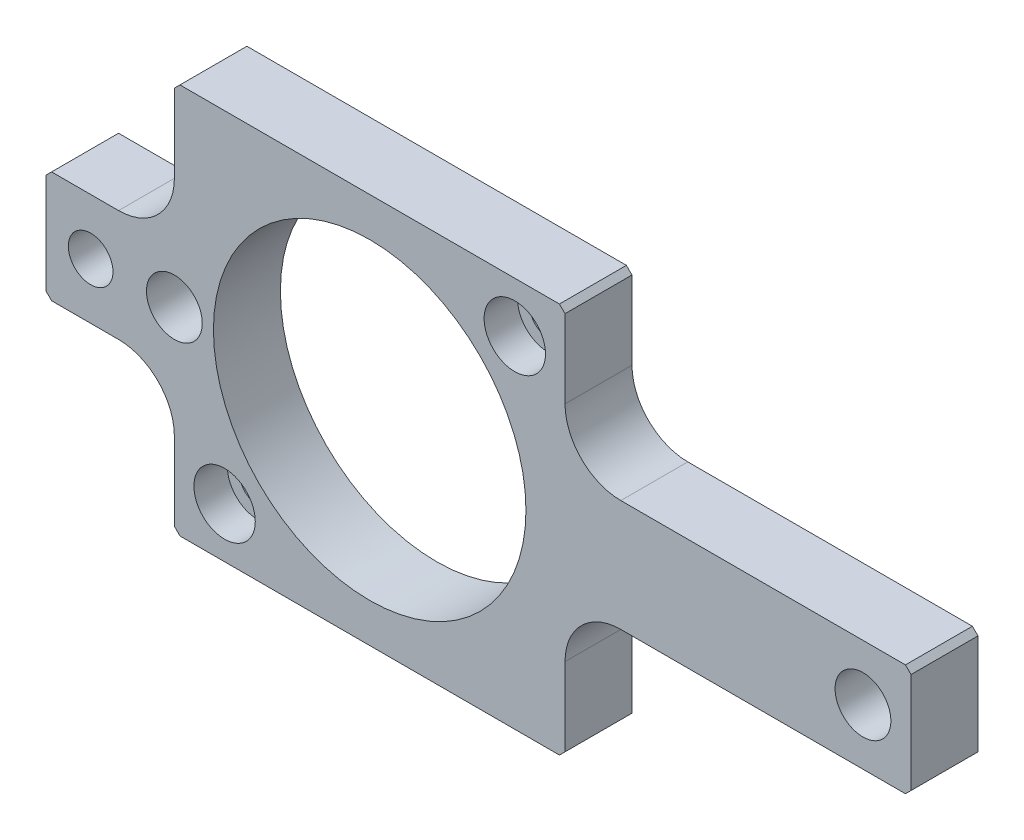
ISO-10303-21;
HEADER;
FILE_DESCRIPTION(('STEP AP214'),'2;1');
FILE_NAME('part.step','',(''),(''),'','','');
FILE_SCHEMA(('AUTOMOTIVE_DESIGN { 1 0 10303 214 1 1 1 1 }'));
ENDSEC;
DATA;
#1=APPLICATION_CONTEXT('core data for automotive mechanical design processes');
#2=APPLICATION_PROTOCOL_DEFINITION('international standard','automotive_design',2000,#1);
#3=PRODUCT_CONTEXT('',#1,'mechanical');
#4=PRODUCT('Part','Part','',(#3));
#5=PRODUCT_RELATED_PRODUCT_CATEGORY('part','',(#4));
#6=PRODUCT_DEFINITION_FORMATION('','',#4);
#7=PRODUCT_DEFINITION_CONTEXT('part definition',#1,'design');
#8=PRODUCT_DEFINITION('design','',#6,#7);
#9=PRODUCT_DEFINITION_SHAPE('','',#8);
#10=(LENGTH_UNIT() NAMED_UNIT(*) SI_UNIT(.MILLI.,.METRE.));
#11=(NAMED_UNIT(*) PLANE_ANGLE_UNIT() SI_UNIT($,.RADIAN.));
#12=(NAMED_UNIT(*) SI_UNIT($,.STERADIAN.) SOLID_ANGLE_UNIT());
#13=UNCERTAINTY_MEASURE_WITH_UNIT(LENGTH_MEASURE(1.E-05),#10,'distance_accuracy_value','');
#14=(GEOMETRIC_REPRESENTATION_CONTEXT(3) GLOBAL_UNCERTAINTY_ASSIGNED_CONTEXT((#13)) GLOBAL_UNIT_ASSIGNED_CONTEXT((#10,
#11,#12)) REPRESENTATION_CONTEXT('',''));
#15=CARTESIAN_POINT('',(0.,0.,0.));
#16=DIRECTION('',(0.,0.,1.));
#17=DIRECTION('',(1.,0.,0.));
#18=AXIS2_PLACEMENT_3D('',#15,#16,#17);
#19=CARTESIAN_POINT('',(80.,15.,12.));
#20=DIRECTION('',(0.,0.,-1.));
#21=DIRECTION('',(-1.,0.,0.));
#22=AXIS2_PLACEMENT_3D('',#19,#20,#21);
#23=PLANE('',#22);
#24=CARTESIAN_POINT('',(123.39,35.,12.));
#25=DIRECTION('',(0.,0.,1.));
#26=DIRECTION('',(1.,0.,0.));
#27=AXIS2_PLACEMENT_3D('',#24,#25,#26);
#28=CIRCLE('',#27,4.99999999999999);
#29=CARTESIAN_POINT('',(128.39,35.,12.));
#30=VERTEX_POINT('',#29);
#31=EDGE_CURVE('E514',#30,#30,#28,.T.);
#32=ORIENTED_EDGE('',*,*,#31,.F.);
#33=EDGE_LOOP('',(#32));
#34=FACE_BOUND('',#33,.T.);
#35=CARTESIAN_POINT('',(-15.,35.,12.));
#36=DIRECTION('',(0.,0.,1.));
#37=DIRECTION('',(1.,0.,0.));
#38=AXIS2_PLACEMENT_3D('',#35,#36,#37);
#39=CIRCLE('',#38,4.);
#40=CARTESIAN_POINT('',(-11.,35.,12.));
#41=VERTEX_POINT('',#40);
#42=EDGE_CURVE('E508',#41,#41,#39,.T.);
#43=ORIENTED_EDGE('',*,*,#42,.F.);
#44=EDGE_LOOP('',(#43));
#45=FACE_BOUND('',#44,.T.);
#46=CARTESIAN_POINT('',(0.,35.,12.));
#47=DIRECTION('',(0.,0.,1.));
#48=DIRECTION('',(1.,0.,0.));
#49=AXIS2_PLACEMENT_3D('',#46,#47,#48);
#50=CIRCLE('',#49,5.);
#51=CARTESIAN_POINT('',(5.,35.,12.));
#52=VERTEX_POINT('',#51);
#53=EDGE_CURVE('E502',#52,#52,#50,.T.);
#54=ORIENTED_EDGE('',*,*,#53,.F.);
#55=EDGE_LOOP('',(#54));
#56=FACE_BOUND('',#55,.T.);
#57=CARTESIAN_POINT('',(9.00000000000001,9.00000000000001,12.));
#58=DIRECTION('',(0.,0.,1.));
#59=DIRECTION('',(1.,0.,0.));
#60=AXIS2_PLACEMENT_3D('',#57,#58,#59);
#61=CIRCLE('',#60,5.5);
#62=CARTESIAN_POINT('',(14.5,9.00000000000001,12.));
#63=VERTEX_POINT('',#62);
#64=EDGE_CURVE('E496',#63,#63,#61,.T.);
#65=ORIENTED_EDGE('',*,*,#64,.F.);
#66=EDGE_LOOP('',(#65));
#67=FACE_BOUND('',#66,.T.);
#68=CARTESIAN_POINT('',(61.,61.,12.));
#69=DIRECTION('',(0.,0.,1.));
#70=DIRECTION('',(1.,0.,0.));
#71=AXIS2_PLACEMENT_3D('',#68,#69,#70);
#72=CIRCLE('',#71,5.5);
#73=CARTESIAN_POINT('',(66.5,61.,12.));
#74=VERTEX_POINT('',#73);
#75=EDGE_CURVE('E484',#74,#74,#72,.T.);
#76=ORIENTED_EDGE('',*,*,#75,.F.);
#77=EDGE_LOOP('',(#76));
#78=FACE_BOUND('',#77,.T.);
#79=DIRECTION('',(0.,-1.,0.));
#80=VECTOR('',#79,1.);
#81=CARTESIAN_POINT('',(0.,14.9999999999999,12.));
#82=LINE('',#81,#80);
#83=CARTESIAN_POINT('',(0.,14.9999999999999,12.));
#84=VERTEX_POINT('',#83);
#85=CARTESIAN_POINT('',(0.,1.00000000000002,12.));
#86=VERTEX_POINT('',#85);
#87=EDGE_CURVE('E251',#84,#86,#82,.T.);
#88=ORIENTED_EDGE('',*,*,#87,.T.);
#89=DIRECTION('',(-0.707106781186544,0.707106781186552,0.));
#90=VECTOR('',#89,1.);
#91=CARTESIAN_POINT('',(1.00000000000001,0.,12.));
#92=LINE('',#91,#90);
#93=CARTESIAN_POINT('',(1.00000000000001,0.,12.));
#94=VERTEX_POINT('',#93);
#95=EDGE_CURVE('E343',#86,#94,#92,.F.);
#96=ORIENTED_EDGE('',*,*,#95,.T.);
#97=DIRECTION('',(1.,0.,0.));
#98=VECTOR('',#97,1.);
#99=CARTESIAN_POINT('',(0.,0.,12.));
#100=LINE('',#99,#98);
#101=CARTESIAN_POINT('',(69.,0.,12.));
#102=VERTEX_POINT('',#101);
#103=EDGE_CURVE('E254',#94,#102,#100,.T.);
#104=ORIENTED_EDGE('',*,*,#103,.T.);
#105=DIRECTION('',(-0.707106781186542,-0.707106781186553,0.));
#106=VECTOR('',#105,1.);
#107=CARTESIAN_POINT('',(70.,1.00000000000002,12.));
#108=LINE('',#107,#106);
#109=CARTESIAN_POINT('',(70.,1.00000000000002,12.));
#110=VERTEX_POINT('',#109);
#111=EDGE_CURVE('E330',#102,#110,#108,.F.);
#112=ORIENTED_EDGE('',*,*,#111,.T.);
#113=DIRECTION('',(0.,1.,0.));
#114=VECTOR('',#113,1.);
#115=CARTESIAN_POINT('',(70.,0.,12.));
#116=LINE('',#115,#114);
#117=CARTESIAN_POINT('',(70.,14.9999999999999,12.));
#118=VERTEX_POINT('',#117);
#119=EDGE_CURVE('E257',#110,#118,#116,.T.);
#120=ORIENTED_EDGE('',*,*,#119,.T.);
#121=CARTESIAN_POINT('',(80.,15.,12.));
#122=DIRECTION('',(0.,0.,-1.));
#123=DIRECTION('',(-1.,0.,0.));
#124=AXIS2_PLACEMENT_3D('',#121,#122,#123);
#125=CIRCLE('',#124,10.);
#126=CARTESIAN_POINT('',(80.0000000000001,25.,12.));
#127=VERTEX_POINT('',#126);
#128=EDGE_CURVE('E211',#118,#127,#125,.T.);
#129=ORIENTED_EDGE('',*,*,#128,.T.);
#130=DIRECTION('',(1.,0.,0.));
#131=VECTOR('',#130,1.);
#132=CARTESIAN_POINT('',(80.0000000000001,25.,12.));
#133=LINE('',#132,#131);
#134=CARTESIAN_POINT('',(131.,25.,12.));
#135=VERTEX_POINT('',#134);
#136=EDGE_CURVE('E260',#127,#135,#133,.T.);
#137=ORIENTED_EDGE('',*,*,#136,.T.);
#138=DIRECTION('',(-0.707106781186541,-0.707106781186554,0.));
#139=VECTOR('',#138,1.);
#140=CARTESIAN_POINT('',(132.,26.,12.));
#141=LINE('',#140,#139);
#142=CARTESIAN_POINT('',(132.,26.,12.));
#143=VERTEX_POINT('',#142);
#144=EDGE_CURVE('E332',#135,#143,#141,.F.);
#145=ORIENTED_EDGE('',*,*,#144,.T.);
#146=DIRECTION('',(0.,1.,0.));
#147=VECTOR('',#146,1.);
#148=CARTESIAN_POINT('',(132.,25.,12.));
#149=LINE('',#148,#147);
#150=CARTESIAN_POINT('',(132.,44.,12.));
#151=VERTEX_POINT('',#150);
#152=EDGE_CURVE('E263',#143,#151,#149,.T.);
#153=ORIENTED_EDGE('',*,*,#152,.T.);
#154=DIRECTION('',(0.707106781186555,-0.70710678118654,0.));
#155=VECTOR('',#154,1.);
#156=CARTESIAN_POINT('',(131.,45.,12.));
#157=LINE('',#156,#155);
#158=CARTESIAN_POINT('',(131.,45.,12.));
#159=VERTEX_POINT('',#158);
#160=EDGE_CURVE('E334',#151,#159,#157,.F.);
#161=ORIENTED_EDGE('',*,*,#160,.T.);
#162=DIRECTION('',(-1.,0.,0.));
#163=VECTOR('',#162,1.);
#164=CARTESIAN_POINT('',(132.,45.,12.));
#165=LINE('',#164,#163);
#166=CARTESIAN_POINT('',(80.0000000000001,45.,12.));
#167=VERTEX_POINT('',#166);
#168=EDGE_CURVE('E266',#159,#167,#165,.T.);
#169=ORIENTED_EDGE('',*,*,#168,.T.);
#170=CARTESIAN_POINT('',(80.,55.,12.));
#171=DIRECTION('',(0.,0.,-1.));
#172=DIRECTION('',(1.,0.,0.));
#173=AXIS2_PLACEMENT_3D('',#170,#171,#172);
#174=CIRCLE('',#173,10.);
#175=CARTESIAN_POINT('',(70.,55.0000000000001,12.));
#176=VERTEX_POINT('',#175);
#177=EDGE_CURVE('E268',#167,#176,#174,.T.);
#178=ORIENTED_EDGE('',*,*,#177,.T.);
#179=DIRECTION('',(0.,1.,0.));
#180=VECTOR('',#179,1.);
#181=CARTESIAN_POINT('',(70.,55.0000000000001,12.));
#182=LINE('',#181,#180);
#183=CARTESIAN_POINT('',(70.,69.,12.));
#184=VERTEX_POINT('',#183);
#185=EDGE_CURVE('E270',#176,#184,#182,.T.);
#186=ORIENTED_EDGE('',*,*,#185,.T.);
#187=DIRECTION('',(0.707106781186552,-0.707106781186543,0.));
#188=VECTOR('',#187,1.);
#189=CARTESIAN_POINT('',(69.,70.,12.));
#190=LINE('',#189,#188);
#191=CARTESIAN_POINT('',(69.,70.,12.));
#192=VERTEX_POINT('',#191);
#193=EDGE_CURVE('E336',#184,#192,#190,.F.);
#194=ORIENTED_EDGE('',*,*,#193,.T.);
#195=DIRECTION('',(-1.,0.,0.));
#196=VECTOR('',#195,1.);
#197=CARTESIAN_POINT('',(70.,70.,12.));
#198=LINE('',#197,#196);
#199=CARTESIAN_POINT('',(1.,70.,12.));
#200=VERTEX_POINT('',#199);
#201=EDGE_CURVE('E273',#192,#200,#198,.T.);
#202=ORIENTED_EDGE('',*,*,#201,.T.);
#203=DIRECTION('',(0.707106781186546,0.707106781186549,0.));
#204=VECTOR('',#203,1.);
#205=CARTESIAN_POINT('',(0.,69.,12.));
#206=LINE('',#205,#204);
#207=CARTESIAN_POINT('',(0.,69.,12.));
#208=VERTEX_POINT('',#207);
#209=EDGE_CURVE('E338',#200,#208,#206,.F.);
#210=ORIENTED_EDGE('',*,*,#209,.T.);
#211=DIRECTION('',(0.,-1.,0.));
#212=VECTOR('',#211,1.);
#213=CARTESIAN_POINT('',(0.,70.,12.));
#214=LINE('',#213,#212);
#215=CARTESIAN_POINT('',(0.,55.0000000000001,12.));
#216=VERTEX_POINT('',#215);
#217=EDGE_CURVE('E276',#208,#216,#214,.T.);
#218=ORIENTED_EDGE('',*,*,#217,.T.);
#219=CARTESIAN_POINT('',(-10.,55.,12.));
#220=DIRECTION('',(0.,0.,-1.));
#221=DIRECTION('',(-1.,0.,0.));
#222=AXIS2_PLACEMENT_3D('',#219,#220,#221);
#223=CIRCLE('',#222,10.);
#224=CARTESIAN_POINT('',(-10.0000000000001,45.,12.));
#225=VERTEX_POINT('',#224);
#226=EDGE_CURVE('E278',#216,#225,#223,.T.);
#227=ORIENTED_EDGE('',*,*,#226,.T.);
#228=DIRECTION('',(-1.,0.,0.));
#229=VECTOR('',#228,1.);
#230=CARTESIAN_POINT('',(-10.0000000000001,45.,12.));
#231=LINE('',#230,#229);
#232=CARTESIAN_POINT('',(-22.,45.,12.));
#233=VERTEX_POINT('',#232);
#234=EDGE_CURVE('E280',#225,#233,#231,.T.);
#235=ORIENTED_EDGE('',*,*,#234,.T.);
#236=DIRECTION('',(0.707106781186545,0.70710678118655,0.));
#237=VECTOR('',#236,1.);
#238=CARTESIAN_POINT('',(-23.,44.,12.));
#239=LINE('',#238,#237);
#240=CARTESIAN_POINT('',(-23.,44.,12.));
#241=VERTEX_POINT('',#240);
#242=EDGE_CURVE('E340',#233,#241,#239,.F.);
#243=ORIENTED_EDGE('',*,*,#242,.T.);
#244=DIRECTION('',(0.,-1.,0.));
#245=VECTOR('',#244,1.);
#246=CARTESIAN_POINT('',(-23.,45.,12.));
#247=LINE('',#246,#245);
#248=CARTESIAN_POINT('',(-23.,26.,12.));
#249=VERTEX_POINT('',#248);
#250=EDGE_CURVE('E283',#241,#249,#247,.T.);
#251=ORIENTED_EDGE('',*,*,#250,.T.);
#252=DIRECTION('',(-0.707106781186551,0.707106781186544,0.));
#253=VECTOR('',#252,1.);
#254=CARTESIAN_POINT('',(-22.,25.,12.));
#255=LINE('',#254,#253);
#256=CARTESIAN_POINT('',(-22.,25.,12.));
#257=VERTEX_POINT('',#256);
#258=EDGE_CURVE('E47',#249,#257,#255,.F.);
#259=ORIENTED_EDGE('',*,*,#258,.T.);
#260=DIRECTION('',(1.,0.,0.));
#261=VECTOR('',#260,1.);
#262=CARTESIAN_POINT('',(-23.,25.,12.));
#263=LINE('',#262,#261);
#264=CARTESIAN_POINT('',(-10.0000000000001,25.,12.));
#265=VERTEX_POINT('',#264);
#266=EDGE_CURVE('E285',#257,#265,#263,.T.);
#267=ORIENTED_EDGE('',*,*,#266,.T.);
#268=CARTESIAN_POINT('',(-10.,15.,12.));
#269=DIRECTION('',(0.,0.,-1.));
#270=DIRECTION('',(1.,0.,0.));
#271=AXIS2_PLACEMENT_3D('',#268,#269,#270);
#272=CIRCLE('',#271,10.);
#273=EDGE_CURVE('E287',#265,#84,#272,.T.);
#274=ORIENTED_EDGE('',*,*,#273,.T.);
#275=EDGE_LOOP('',(#88,#96,#104,#112,#120,#129,#137,#145,#153,#161,#169,#178,#186,#194,#202,
#210,#218,#227,#235,#243,#251,#259,#267,#274));
#276=FACE_BOUND('',#275,.T.);
#277=CARTESIAN_POINT('',(35.,35.,12.));
#278=DIRECTION('',(0.,0.,1.));
#279=DIRECTION('',(1.,0.,0.));
#280=AXIS2_PLACEMENT_3D('',#277,#278,#279);
#281=CIRCLE('',#280,28.);
#282=CARTESIAN_POINT('',(63.,35.,12.));
#283=VERTEX_POINT('',#282);
#284=EDGE_CURVE('E467',#283,#283,#281,.T.);
#285=ORIENTED_EDGE('',*,*,#284,.F.);
#286=EDGE_LOOP('',(#285));
#287=FACE_BOUND('',#286,.T.);
#288=ADVANCED_FACE('F32',(#34,#45,#56,#67,#78,#276,#287),#23,.F.);
#289=CARTESIAN_POINT('',(80.,15.,0.));
#290=DIRECTION('',(0.,0.,-1.));
#291=DIRECTION('',(-1.,0.,0.));
#292=AXIS2_PLACEMENT_3D('',#289,#290,#291);
#293=PLANE('',#292);
#294=CARTESIAN_POINT('',(123.39,35.,-4.49293380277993E-13));
#295=DIRECTION('',(0.,0.,1.));
#296=DIRECTION('',(1.,0.,0.));
#297=AXIS2_PLACEMENT_3D('',#294,#295,#296);
#298=CIRCLE('',#297,4.99999999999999);
#299=CARTESIAN_POINT('',(128.39,35.,-4.49293380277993E-13));
#300=VERTEX_POINT('',#299);
#301=EDGE_CURVE('E511',#300,#300,#298,.T.);
#302=ORIENTED_EDGE('',*,*,#301,.T.);
#303=EDGE_LOOP('',(#302));
#304=FACE_BOUND('',#303,.T.);
#305=CARTESIAN_POINT('',(-15.,35.,-4.49293380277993E-13));
#306=DIRECTION('',(0.,0.,1.));
#307=DIRECTION('',(1.,0.,0.));
#308=AXIS2_PLACEMENT_3D('',#305,#306,#307);
#309=CIRCLE('',#308,4.);
#310=CARTESIAN_POINT('',(-11.,35.,-4.49293380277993E-13));
#311=VERTEX_POINT('',#310);
#312=EDGE_CURVE('E505',#311,#311,#309,.T.);
#313=ORIENTED_EDGE('',*,*,#312,.T.);
#314=EDGE_LOOP('',(#313));
#315=FACE_BOUND('',#314,.T.);
#316=CARTESIAN_POINT('',(0.,35.,-4.49293380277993E-13));
#317=DIRECTION('',(0.,0.,1.));
#318=DIRECTION('',(1.,0.,0.));
#319=AXIS2_PLACEMENT_3D('',#316,#317,#318);
#320=CIRCLE('',#319,5.);
#321=CARTESIAN_POINT('',(5.,35.,-4.49293380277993E-13));
#322=VERTEX_POINT('',#321);
#323=EDGE_CURVE('E499',#322,#322,#320,.T.);
#324=ORIENTED_EDGE('',*,*,#323,.T.);
#325=EDGE_LOOP('',(#324));
#326=FACE_BOUND('',#325,.T.);
#327=CARTESIAN_POINT('',(9.00000000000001,9.00000000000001,-4.49293380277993E-13));
#328=DIRECTION('',(0.,0.,1.));
#329=DIRECTION('',(1.,0.,0.));
#330=AXIS2_PLACEMENT_3D('',#327,#328,#329);
#331=CIRCLE('',#330,3.3);
#332=CARTESIAN_POINT('',(12.3,9.00000000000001,-4.49293380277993E-13));
#333=VERTEX_POINT('',#332);
#334=EDGE_CURVE('E487',#333,#333,#331,.T.);
#335=ORIENTED_EDGE('',*,*,#334,.T.);
#336=EDGE_LOOP('',(#335));
#337=FACE_BOUND('',#336,.T.);
#338=CARTESIAN_POINT('',(61.,61.,-4.49293380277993E-13));
#339=DIRECTION('',(0.,0.,1.));
#340=DIRECTION('',(1.,0.,0.));
#341=AXIS2_PLACEMENT_3D('',#338,#339,#340);
#342=CIRCLE('',#341,3.3);
#343=CARTESIAN_POINT('',(64.3,61.,-4.49293380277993E-13));
#344=VERTEX_POINT('',#343);
#345=EDGE_CURVE('E475',#344,#344,#342,.T.);
#346=ORIENTED_EDGE('',*,*,#345,.T.);
#347=EDGE_LOOP('',(#346));
#348=FACE_BOUND('',#347,.T.);
#349=DIRECTION('',(1.,0.,0.));
#350=VECTOR('',#349,1.);
#351=CARTESIAN_POINT('',(0.,0.,0.));
#352=LINE('',#351,#350);
#353=CARTESIAN_POINT('',(0.999999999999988,0.,0.));
#354=VERTEX_POINT('',#353);
#355=CARTESIAN_POINT('',(69.,0.,0.));
#356=VERTEX_POINT('',#355);
#357=EDGE_CURVE('E205',#354,#356,#352,.T.);
#358=ORIENTED_EDGE('',*,*,#357,.F.);
#359=DIRECTION('',(0.707106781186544,-0.707106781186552,0.));
#360=VECTOR('',#359,1.);
#361=CARTESIAN_POINT('',(32.9999999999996,-31.9999999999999,0.));
#362=LINE('',#361,#360);
#363=CARTESIAN_POINT('',(0.,1.00000000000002,0.));
#364=VERTEX_POINT('',#363);
#365=EDGE_CURVE('E326',#354,#364,#362,.F.);
#366=ORIENTED_EDGE('',*,*,#365,.T.);
#367=DIRECTION('',(0.,-1.,0.));
#368=VECTOR('',#367,1.);
#369=CARTESIAN_POINT('',(0.,14.9999999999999,0.));
#370=LINE('',#369,#368);
#371=CARTESIAN_POINT('',(0.,14.9999999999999,0.));
#372=VERTEX_POINT('',#371);
#373=EDGE_CURVE('E455',#372,#364,#370,.T.);
#374=ORIENTED_EDGE('',*,*,#373,.F.);
#375=CARTESIAN_POINT('',(-10.,15.,0.));
#376=DIRECTION('',(0.,0.,-1.));
#377=DIRECTION('',(1.,0.,0.));
#378=AXIS2_PLACEMENT_3D('',#375,#376,#377);
#379=CIRCLE('',#378,10.);
#380=CARTESIAN_POINT('',(-10.0000000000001,25.,0.));
#381=VERTEX_POINT('',#380);
#382=EDGE_CURVE('E249',#381,#372,#379,.T.);
#383=ORIENTED_EDGE('',*,*,#382,.F.);
#384=DIRECTION('',(1.,0.,0.));
#385=VECTOR('',#384,1.);
#386=CARTESIAN_POINT('',(-23.,25.,0.));
#387=LINE('',#386,#385);
#388=CARTESIAN_POINT('',(-22.,25.,0.));
#389=VERTEX_POINT('',#388);
#390=EDGE_CURVE('E247',#389,#381,#387,.T.);
#391=ORIENTED_EDGE('',*,*,#390,.F.);
#392=DIRECTION('',(0.707106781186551,-0.707106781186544,0.));
#393=VECTOR('',#392,1.);
#394=CARTESIAN_POINT('',(34.0000000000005,-30.9999999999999,0.));
#395=LINE('',#394,#393);
#396=CARTESIAN_POINT('',(-23.,26.,0.));
#397=VERTEX_POINT('',#396);
#398=EDGE_CURVE('E324',#389,#397,#395,.F.);
#399=ORIENTED_EDGE('',*,*,#398,.T.);
#400=DIRECTION('',(0.,-1.,0.));
#401=VECTOR('',#400,1.);
#402=CARTESIAN_POINT('',(-23.,45.,0.));
#403=LINE('',#402,#401);
#404=CARTESIAN_POINT('',(-23.,44.,0.));
#405=VERTEX_POINT('',#404);
#406=EDGE_CURVE('E245',#405,#397,#403,.T.);
#407=ORIENTED_EDGE('',*,*,#406,.F.);
#408=DIRECTION('',(-0.707106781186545,-0.70710678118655,0.));
#409=VECTOR('',#408,1.);
#410=CARTESIAN_POINT('',(13.9999999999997,80.9999999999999,0.));
#411=LINE('',#410,#409);
#412=CARTESIAN_POINT('',(-22.,45.,0.));
#413=VERTEX_POINT('',#412);
#414=EDGE_CURVE('E322',#405,#413,#411,.F.);
#415=ORIENTED_EDGE('',*,*,#414,.T.);
#416=DIRECTION('',(-1.,0.,0.));
#417=VECTOR('',#416,1.);
#418=CARTESIAN_POINT('',(-10.0000000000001,45.,0.));
#419=LINE('',#418,#417);
#420=CARTESIAN_POINT('',(-10.0000000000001,45.,0.));
#421=VERTEX_POINT('',#420);
#422=EDGE_CURVE('E242',#421,#413,#419,.T.);
#423=ORIENTED_EDGE('',*,*,#422,.F.);
#424=CARTESIAN_POINT('',(-10.,55.,0.));
#425=DIRECTION('',(0.,0.,-1.));
#426=DIRECTION('',(-1.,0.,0.));
#427=AXIS2_PLACEMENT_3D('',#424,#425,#426);
#428=CIRCLE('',#427,10.);
#429=CARTESIAN_POINT('',(0.,55.0000000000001,0.));
#430=VERTEX_POINT('',#429);
#431=EDGE_CURVE('E240',#430,#421,#428,.T.);
#432=ORIENTED_EDGE('',*,*,#431,.F.);
#433=DIRECTION('',(0.,-1.,0.));
#434=VECTOR('',#433,1.);
#435=CARTESIAN_POINT('',(0.,70.,0.));
#436=LINE('',#435,#434);
#437=CARTESIAN_POINT('',(0.,69.,0.));
#438=VERTEX_POINT('',#437);
#439=EDGE_CURVE('E238',#438,#430,#436,.T.);
#440=ORIENTED_EDGE('',*,*,#439,.F.);
#441=DIRECTION('',(-0.707106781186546,-0.707106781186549,0.));
#442=VECTOR('',#441,1.);
#443=CARTESIAN_POINT('',(12.9999999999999,81.9999999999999,0.));
#444=LINE('',#443,#442);
#445=CARTESIAN_POINT('',(1.,70.,0.));
#446=VERTEX_POINT('',#445);
#447=EDGE_CURVE('E320',#438,#446,#444,.F.);
#448=ORIENTED_EDGE('',*,*,#447,.T.);
#449=DIRECTION('',(-1.,0.,0.));
#450=VECTOR('',#449,1.);
#451=CARTESIAN_POINT('',(70.,70.,0.));
#452=LINE('',#451,#450);
#453=CARTESIAN_POINT('',(69.,70.,0.));
#454=VERTEX_POINT('',#453);
#455=EDGE_CURVE('E235',#454,#446,#452,.T.);
#456=ORIENTED_EDGE('',*,*,#455,.F.);
#457=DIRECTION('',(-0.707106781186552,0.707106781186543,0.));
#458=VECTOR('',#457,1.);
#459=CARTESIAN_POINT('',(102.,37.0000000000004,0.));
#460=LINE('',#459,#458);
#461=CARTESIAN_POINT('',(70.,69.,0.));
#462=VERTEX_POINT('',#461);
#463=EDGE_CURVE('E318',#454,#462,#460,.F.);
#464=ORIENTED_EDGE('',*,*,#463,.T.);
#465=DIRECTION('',(0.,1.,0.));
#466=VECTOR('',#465,1.);
#467=CARTESIAN_POINT('',(70.,55.0000000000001,0.));
#468=LINE('',#467,#466);
#469=CARTESIAN_POINT('',(70.,55.0000000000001,0.));
#470=VERTEX_POINT('',#469);
#471=EDGE_CURVE('E232',#470,#462,#468,.T.);
#472=ORIENTED_EDGE('',*,*,#471,.F.);
#473=CARTESIAN_POINT('',(80.,55.,0.));
#474=DIRECTION('',(0.,0.,-1.));
#475=DIRECTION('',(1.,0.,0.));
#476=AXIS2_PLACEMENT_3D('',#473,#474,#475);
#477=CIRCLE('',#476,10.);
#478=CARTESIAN_POINT('',(80.0000000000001,45.,0.));
#479=VERTEX_POINT('',#478);
#480=EDGE_CURVE('E230',#479,#470,#477,.T.);
#481=ORIENTED_EDGE('',*,*,#480,.F.);
#482=DIRECTION('',(-1.,0.,0.));
#483=VECTOR('',#482,1.);
#484=CARTESIAN_POINT('',(132.,45.,0.));
#485=LINE('',#484,#483);
#486=CARTESIAN_POINT('',(131.,45.,0.));
#487=VERTEX_POINT('',#486);
#488=EDGE_CURVE('E228',#487,#479,#485,.T.);
#489=ORIENTED_EDGE('',*,*,#488,.F.);
#490=DIRECTION('',(-0.707106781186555,0.70710678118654,0.));
#491=VECTOR('',#490,1.);
#492=CARTESIAN_POINT('',(120.499999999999,55.5000000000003,0.));
#493=LINE('',#492,#491);
#494=CARTESIAN_POINT('',(132.,44.,0.));
#495=VERTEX_POINT('',#494);
#496=EDGE_CURVE('E316',#487,#495,#493,.F.);
#497=ORIENTED_EDGE('',*,*,#496,.T.);
#498=DIRECTION('',(0.,1.,0.));
#499=VECTOR('',#498,1.);
#500=CARTESIAN_POINT('',(132.,25.,0.));
#501=LINE('',#500,#499);
#502=CARTESIAN_POINT('',(132.,26.,0.));
#503=VERTEX_POINT('',#502);
#504=EDGE_CURVE('E222',#503,#495,#501,.T.);
#505=ORIENTED_EDGE('',*,*,#504,.F.);
#506=DIRECTION('',(0.707106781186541,0.707106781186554,0.));
#507=VECTOR('',#506,1.);
#508=CARTESIAN_POINT('',(100.5,-5.50000000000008,0.));
#509=LINE('',#508,#507);
#510=CARTESIAN_POINT('',(131.,25.,0.));
#511=VERTEX_POINT('',#510);
#512=EDGE_CURVE('E314',#503,#511,#509,.F.);
#513=ORIENTED_EDGE('',*,*,#512,.T.);
#514=DIRECTION('',(1.,0.,0.));
#515=VECTOR('',#514,1.);
#516=CARTESIAN_POINT('',(80.0000000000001,25.,0.));
#517=LINE('',#516,#515);
#518=CARTESIAN_POINT('',(80.0000000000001,25.,0.));
#519=VERTEX_POINT('',#518);
#520=EDGE_CURVE('E220',#519,#511,#517,.T.);
#521=ORIENTED_EDGE('',*,*,#520,.F.);
#522=CARTESIAN_POINT('',(80.,15.,0.));
#523=DIRECTION('',(0.,0.,-1.));
#524=DIRECTION('',(-1.,0.,0.));
#525=AXIS2_PLACEMENT_3D('',#522,#523,#524);
#526=CIRCLE('',#525,10.);
#527=CARTESIAN_POINT('',(70.,14.9999999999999,0.));
#528=VERTEX_POINT('',#527);
#529=EDGE_CURVE('E204',#528,#519,#526,.T.);
#530=ORIENTED_EDGE('',*,*,#529,.F.);
#531=DIRECTION('',(0.,1.,0.));
#532=VECTOR('',#531,1.);
#533=CARTESIAN_POINT('',(70.,0.,0.));
#534=LINE('',#533,#532);
#535=CARTESIAN_POINT('',(70.,1.00000000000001,0.));
#536=VERTEX_POINT('',#535);
#537=EDGE_CURVE('E195',#536,#528,#534,.T.);
#538=ORIENTED_EDGE('',*,*,#537,.F.);
#539=DIRECTION('',(0.707106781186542,0.707106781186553,0.));
#540=VECTOR('',#539,1.);
#541=CARTESIAN_POINT('',(81.9999999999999,13.0000000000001,0.));
#542=LINE('',#541,#540);
#543=EDGE_CURVE('E312',#536,#356,#542,.F.);
#544=ORIENTED_EDGE('',*,*,#543,.T.);
#545=EDGE_LOOP('',(#358,#366,#374,#383,#391,#399,#407,#415,#423,#432,#440,#448,#456,#464,#472,
#481,#489,#497,#505,#513,#521,#530,#538,#544));
#546=FACE_BOUND('',#545,.T.);
#547=CARTESIAN_POINT('',(35.,35.,0.));
#548=DIRECTION('',(0.,0.,1.));
#549=DIRECTION('',(1.,0.,0.));
#550=AXIS2_PLACEMENT_3D('',#547,#548,#549);
#551=CIRCLE('',#550,28.);
#552=CARTESIAN_POINT('',(63.,35.,0.));
#553=VERTEX_POINT('',#552);
#554=EDGE_CURVE('E472',#553,#553,#551,.T.);
#555=ORIENTED_EDGE('',*,*,#554,.T.);
#556=EDGE_LOOP('',(#555));
#557=FACE_BOUND('',#556,.T.);
#558=ADVANCED_FACE('F217',(#304,#315,#326,#337,#348,#546,#557),#293,.T.);
#559=CARTESIAN_POINT('',(0.,14.9999999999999,12.));
#560=DIRECTION('',(1.,0.,0.));
#561=DIRECTION('',(0.,1.,0.));
#562=AXIS2_PLACEMENT_3D('',#559,#560,#561);
#563=PLANE('',#562);
#564=ORIENTED_EDGE('',*,*,#373,.T.);
#565=DIRECTION('',(0.,0.,1.));
#566=VECTOR('',#565,1.);
#567=CARTESIAN_POINT('',(0.,1.00000000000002,12.));
#568=LINE('',#567,#566);
#569=EDGE_CURVE('E328',#364,#86,#568,.T.);
#570=ORIENTED_EDGE('',*,*,#569,.T.);
#571=ORIENTED_EDGE('',*,*,#87,.F.);
#572=DIRECTION('',(0.,0.,-1.));
#573=VECTOR('',#572,1.);
#574=CARTESIAN_POINT('',(0.,14.9999999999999,12.));
#575=LINE('',#574,#573);
#576=EDGE_CURVE('E289',#84,#372,#575,.T.);
#577=ORIENTED_EDGE('',*,*,#576,.T.);
#578=EDGE_LOOP('',(#564,#570,#571,#577));
#579=FACE_BOUND('',#578,.T.);
#580=ADVANCED_FACE('F34',(#579),#563,.F.);
#581=CARTESIAN_POINT('',(0.,0.,12.));
#582=DIRECTION('',(0.,1.,0.));
#583=DIRECTION('',(0.,0.,1.));
#584=AXIS2_PLACEMENT_3D('',#581,#582,#583);
#585=PLANE('',#584);
#586=ORIENTED_EDGE('',*,*,#103,.F.);
#587=DIRECTION('',(0.,0.,-1.));
#588=VECTOR('',#587,1.);
#589=CARTESIAN_POINT('',(1.00000000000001,0.,12.));
#590=LINE('',#589,#588);
#591=EDGE_CURVE('E309',#94,#354,#590,.T.);
#592=ORIENTED_EDGE('',*,*,#591,.T.);
#593=ORIENTED_EDGE('',*,*,#357,.T.);
#594=DIRECTION('',(0.,0.,1.));
#595=VECTOR('',#594,1.);
#596=CARTESIAN_POINT('',(69.,0.,12.));
#597=LINE('',#596,#595);
#598=EDGE_CURVE('E212',#356,#102,#597,.T.);
#599=ORIENTED_EDGE('',*,*,#598,.T.);
#600=EDGE_LOOP('',(#586,#592,#593,#599));
#601=FACE_BOUND('',#600,.T.);
#602=ADVANCED_FACE('F462',(#601),#585,.F.);
#603=CARTESIAN_POINT('',(70.,0.,12.));
#604=DIRECTION('',(-1.,0.,0.));
#605=DIRECTION('',(0.,0.,1.));
#606=AXIS2_PLACEMENT_3D('',#603,#604,#605);
#607=PLANE('',#606);
#608=ORIENTED_EDGE('',*,*,#119,.F.);
#609=DIRECTION('',(0.,0.,-1.));
#610=VECTOR('',#609,1.);
#611=CARTESIAN_POINT('',(70.,1.00000000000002,12.));
#612=LINE('',#611,#610);
#613=EDGE_CURVE('E11',#110,#536,#612,.T.);
#614=ORIENTED_EDGE('',*,*,#613,.T.);
#615=ORIENTED_EDGE('',*,*,#537,.T.);
#616=DIRECTION('',(0.,0.,-1.));
#617=VECTOR('',#616,1.);
#618=CARTESIAN_POINT('',(70.,14.9999999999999,12.));
#619=LINE('',#618,#617);
#620=EDGE_CURVE('E199',#118,#528,#619,.T.);
#621=ORIENTED_EDGE('',*,*,#620,.F.);
#622=EDGE_LOOP('',(#608,#614,#615,#621));
#623=FACE_BOUND('',#622,.T.);
#624=ADVANCED_FACE('F198',(#623),#607,.F.);
#625=CARTESIAN_POINT('',(80.,15.,12.));
#626=DIRECTION('',(0.,0.,-1.));
#627=DIRECTION('',(-1.,0.,0.));
#628=AXIS2_PLACEMENT_3D('',#625,#626,#627);
#629=CYLINDRICAL_SURFACE('',#628,10.);
#630=ORIENTED_EDGE('',*,*,#529,.T.);
#631=DIRECTION('',(0.,0.,-1.));
#632=VECTOR('',#631,1.);
#633=CARTESIAN_POINT('',(80.0000000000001,25.,12.));
#634=LINE('',#633,#632);
#635=EDGE_CURVE('E213',#127,#519,#634,.T.);
#636=ORIENTED_EDGE('',*,*,#635,.F.);
#637=ORIENTED_EDGE('',*,*,#128,.F.);
#638=ORIENTED_EDGE('',*,*,#620,.T.);
#639=EDGE_LOOP('',(#630,#636,#637,#638));
#640=FACE_BOUND('',#639,.T.);
#641=ADVANCED_FACE('F208',(#640),#629,.F.);
#642=CARTESIAN_POINT('',(80.0000000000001,25.,12.));
#643=DIRECTION('',(0.,1.,0.));
#644=DIRECTION('',(-1.,0.,0.));
#645=AXIS2_PLACEMENT_3D('',#642,#643,#644);
#646=PLANE('',#645);
#647=ORIENTED_EDGE('',*,*,#520,.T.);
#648=DIRECTION('',(0.,0.,1.));
#649=VECTOR('',#648,1.);
#650=CARTESIAN_POINT('',(131.,25.,12.));
#651=LINE('',#650,#649);
#652=EDGE_CURVE('E40',#511,#135,#651,.T.);
#653=ORIENTED_EDGE('',*,*,#652,.T.);
#654=ORIENTED_EDGE('',*,*,#136,.F.);
#655=ORIENTED_EDGE('',*,*,#635,.T.);
#656=EDGE_LOOP('',(#647,#653,#654,#655));
#657=FACE_BOUND('',#656,.T.);
#658=ADVANCED_FACE('F374',(#657),#646,.F.);
#659=CARTESIAN_POINT('',(132.,25.,12.));
#660=DIRECTION('',(-1.,0.,0.));
#661=DIRECTION('',(0.,0.,1.));
#662=AXIS2_PLACEMENT_3D('',#659,#660,#661);
#663=PLANE('',#662);
#664=ORIENTED_EDGE('',*,*,#504,.T.);
#665=DIRECTION('',(0.,0.,1.));
#666=VECTOR('',#665,1.);
#667=CARTESIAN_POINT('',(132.,44.,12.));
#668=LINE('',#667,#666);
#669=EDGE_CURVE('E370',#495,#151,#668,.T.);
#670=ORIENTED_EDGE('',*,*,#669,.T.);
#671=ORIENTED_EDGE('',*,*,#152,.F.);
#672=DIRECTION('',(0.,0.,-1.));
#673=VECTOR('',#672,1.);
#674=CARTESIAN_POINT('',(132.,26.,12.));
#675=LINE('',#674,#673);
#676=EDGE_CURVE('E367',#143,#503,#675,.T.);
#677=ORIENTED_EDGE('',*,*,#676,.T.);
#678=EDGE_LOOP('',(#664,#670,#671,#677));
#679=FACE_BOUND('',#678,.T.);
#680=ADVANCED_FACE('F383',(#679),#663,.F.);
#681=CARTESIAN_POINT('',(132.,45.,12.));
#682=DIRECTION('',(0.,-1.,0.));
#683=DIRECTION('',(1.,0.,0.));
#684=AXIS2_PLACEMENT_3D('',#681,#682,#683);
#685=PLANE('',#684);
#686=ORIENTED_EDGE('',*,*,#168,.F.);
#687=DIRECTION('',(0.,0.,-1.));
#688=VECTOR('',#687,1.);
#689=CARTESIAN_POINT('',(131.,45.,12.));
#690=LINE('',#689,#688);
#691=EDGE_CURVE('E364',#159,#487,#690,.T.);
#692=ORIENTED_EDGE('',*,*,#691,.T.);
#693=ORIENTED_EDGE('',*,*,#488,.T.);
#694=DIRECTION('',(0.,0.,-1.));
#695=VECTOR('',#694,1.);
#696=CARTESIAN_POINT('',(80.0000000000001,45.,12.));
#697=LINE('',#696,#695);
#698=EDGE_CURVE('E304',#167,#479,#697,.T.);
#699=ORIENTED_EDGE('',*,*,#698,.F.);
#700=EDGE_LOOP('',(#686,#692,#693,#699));
#701=FACE_BOUND('',#700,.T.);
#702=ADVANCED_FACE('F393',(#701),#685,.F.);
#703=CARTESIAN_POINT('',(80.,55.,12.));
#704=DIRECTION('',(0.,0.,-1.));
#705=DIRECTION('',(-1.,0.,0.));
#706=AXIS2_PLACEMENT_3D('',#703,#704,#705);
#707=CYLINDRICAL_SURFACE('',#706,10.);
#708=ORIENTED_EDGE('',*,*,#480,.T.);
#709=DIRECTION('',(0.,0.,-1.));
#710=VECTOR('',#709,1.);
#711=CARTESIAN_POINT('',(70.,55.0000000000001,12.));
#712=LINE('',#711,#710);
#713=EDGE_CURVE('E301',#176,#470,#712,.T.);
#714=ORIENTED_EDGE('',*,*,#713,.F.);
#715=ORIENTED_EDGE('',*,*,#177,.F.);
#716=ORIENTED_EDGE('',*,*,#698,.T.);
#717=EDGE_LOOP('',(#708,#714,#715,#716));
#718=FACE_BOUND('',#717,.T.);
#719=ADVANCED_FACE('F400',(#718),#707,.F.);
#720=CARTESIAN_POINT('',(70.,55.0000000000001,12.));
#721=DIRECTION('',(-1.,0.,0.));
#722=DIRECTION('',(0.,-1.,0.));
#723=AXIS2_PLACEMENT_3D('',#720,#721,#722);
#724=PLANE('',#723);
#725=ORIENTED_EDGE('',*,*,#471,.T.);
#726=DIRECTION('',(0.,0.,1.));
#727=VECTOR('',#726,1.);
#728=CARTESIAN_POINT('',(70.,69.,12.));
#729=LINE('',#728,#727);
#730=EDGE_CURVE('E362',#462,#184,#729,.T.);
#731=ORIENTED_EDGE('',*,*,#730,.T.);
#732=ORIENTED_EDGE('',*,*,#185,.F.);
#733=ORIENTED_EDGE('',*,*,#713,.T.);
#734=EDGE_LOOP('',(#725,#731,#732,#733));
#735=FACE_BOUND('',#734,.T.);
#736=ADVANCED_FACE('F403',(#735),#724,.F.);
#737=CARTESIAN_POINT('',(70.,70.,12.));
#738=DIRECTION('',(0.,-1.,0.));
#739=DIRECTION('',(1.,0.,0.));
#740=AXIS2_PLACEMENT_3D('',#737,#738,#739);
#741=PLANE('',#740);
#742=ORIENTED_EDGE('',*,*,#455,.T.);
#743=DIRECTION('',(0.,0.,1.));
#744=VECTOR('',#743,1.);
#745=CARTESIAN_POINT('',(1.,70.,12.));
#746=LINE('',#745,#744);
#747=EDGE_CURVE('E360',#446,#200,#746,.T.);
#748=ORIENTED_EDGE('',*,*,#747,.T.);
#749=ORIENTED_EDGE('',*,*,#201,.F.);
#750=DIRECTION('',(0.,0.,-1.));
#751=VECTOR('',#750,1.);
#752=CARTESIAN_POINT('',(69.,70.,12.));
#753=LINE('',#752,#751);
#754=EDGE_CURVE('E357',#192,#454,#753,.T.);
#755=ORIENTED_EDGE('',*,*,#754,.T.);
#756=EDGE_LOOP('',(#742,#748,#749,#755));
#757=FACE_BOUND('',#756,.T.);
#758=ADVANCED_FACE('F411',(#757),#741,.F.);
#759=CARTESIAN_POINT('',(0.,70.,12.));
#760=DIRECTION('',(1.,0.,0.));
#761=DIRECTION('',(0.,1.,0.));
#762=AXIS2_PLACEMENT_3D('',#759,#760,#761);
#763=PLANE('',#762);
#764=ORIENTED_EDGE('',*,*,#217,.F.);
#765=DIRECTION('',(0.,0.,-1.));
#766=VECTOR('',#765,1.);
#767=CARTESIAN_POINT('',(0.,69.,12.));
#768=LINE('',#767,#766);
#769=EDGE_CURVE('E354',#208,#438,#768,.T.);
#770=ORIENTED_EDGE('',*,*,#769,.T.);
#771=ORIENTED_EDGE('',*,*,#439,.T.);
#772=DIRECTION('',(0.,0.,-1.));
#773=VECTOR('',#772,1.);
#774=CARTESIAN_POINT('',(0.,55.0000000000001,12.));
#775=LINE('',#774,#773);
#776=EDGE_CURVE('E298',#216,#430,#775,.T.);
#777=ORIENTED_EDGE('',*,*,#776,.F.);
#778=EDGE_LOOP('',(#764,#770,#771,#777));
#779=FACE_BOUND('',#778,.T.);
#780=ADVANCED_FACE('F420',(#779),#763,.F.);
#781=CARTESIAN_POINT('',(-10.,55.,12.));
#782=DIRECTION('',(0.,0.,-1.));
#783=DIRECTION('',(-1.,0.,0.));
#784=AXIS2_PLACEMENT_3D('',#781,#782,#783);
#785=CYLINDRICAL_SURFACE('',#784,10.);
#786=ORIENTED_EDGE('',*,*,#431,.T.);
#787=DIRECTION('',(0.,0.,-1.));
#788=VECTOR('',#787,1.);
#789=CARTESIAN_POINT('',(-10.0000000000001,45.,12.));
#790=LINE('',#789,#788);
#791=EDGE_CURVE('E295',#225,#421,#790,.T.);
#792=ORIENTED_EDGE('',*,*,#791,.F.);
#793=ORIENTED_EDGE('',*,*,#226,.F.);
#794=ORIENTED_EDGE('',*,*,#776,.T.);
#795=EDGE_LOOP('',(#786,#792,#793,#794));
#796=FACE_BOUND('',#795,.T.);
#797=ADVANCED_FACE('F426',(#796),#785,.F.);
#798=CARTESIAN_POINT('',(-10.0000000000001,45.,12.));
#799=DIRECTION('',(0.,-1.,0.));
#800=DIRECTION('',(0.,0.,-1.));
#801=AXIS2_PLACEMENT_3D('',#798,#799,#800);
#802=PLANE('',#801);
#803=ORIENTED_EDGE('',*,*,#422,.T.);
#804=DIRECTION('',(0.,0.,1.));
#805=VECTOR('',#804,1.);
#806=CARTESIAN_POINT('',(-22.,45.,12.));
#807=LINE('',#806,#805);
#808=EDGE_CURVE('E352',#413,#233,#807,.T.);
#809=ORIENTED_EDGE('',*,*,#808,.T.);
#810=ORIENTED_EDGE('',*,*,#234,.F.);
#811=ORIENTED_EDGE('',*,*,#791,.T.);
#812=EDGE_LOOP('',(#803,#809,#810,#811));
#813=FACE_BOUND('',#812,.T.);
#814=ADVANCED_FACE('F582',(#813),#802,.F.);
#815=CARTESIAN_POINT('',(-23.,45.,12.));
#816=DIRECTION('',(1.,0.,0.));
#817=DIRECTION('',(0.,1.,0.));
#818=AXIS2_PLACEMENT_3D('',#815,#816,#817);
#819=PLANE('',#818);
#820=ORIENTED_EDGE('',*,*,#406,.T.);
#821=DIRECTION('',(0.,0.,1.));
#822=VECTOR('',#821,1.);
#823=CARTESIAN_POINT('',(-23.,26.,12.));
#824=LINE('',#823,#822);
#825=EDGE_CURVE('E55',#397,#249,#824,.T.);
#826=ORIENTED_EDGE('',*,*,#825,.T.);
#827=ORIENTED_EDGE('',*,*,#250,.F.);
#828=DIRECTION('',(0.,0.,-1.));
#829=VECTOR('',#828,1.);
#830=CARTESIAN_POINT('',(-23.,44.,12.));
#831=LINE('',#830,#829);
#832=EDGE_CURVE('E348',#241,#405,#831,.T.);
#833=ORIENTED_EDGE('',*,*,#832,.T.);
#834=EDGE_LOOP('',(#820,#826,#827,#833));
#835=FACE_BOUND('',#834,.T.);
#836=ADVANCED_FACE('F435',(#835),#819,.F.);
#837=CARTESIAN_POINT('',(-23.,25.,12.));
#838=DIRECTION('',(0.,1.,0.));
#839=DIRECTION('',(0.,0.,1.));
#840=AXIS2_PLACEMENT_3D('',#837,#838,#839);
#841=PLANE('',#840);
#842=ORIENTED_EDGE('',*,*,#266,.F.);
#843=DIRECTION('',(0.,0.,-1.));
#844=VECTOR('',#843,1.);
#845=CARTESIAN_POINT('',(-22.,25.,12.));
#846=LINE('',#845,#844);
#847=EDGE_CURVE('E345',#257,#389,#846,.T.);
#848=ORIENTED_EDGE('',*,*,#847,.T.);
#849=ORIENTED_EDGE('',*,*,#390,.T.);
#850=DIRECTION('',(0.,0.,-1.));
#851=VECTOR('',#850,1.);
#852=CARTESIAN_POINT('',(-10.0000000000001,25.,12.));
#853=LINE('',#852,#851);
#854=EDGE_CURVE('E292',#265,#381,#853,.T.);
#855=ORIENTED_EDGE('',*,*,#854,.F.);
#856=EDGE_LOOP('',(#842,#848,#849,#855));
#857=FACE_BOUND('',#856,.T.);
#858=ADVANCED_FACE('F443',(#857),#841,.F.);
#859=CARTESIAN_POINT('',(-10.,15.,12.));
#860=DIRECTION('',(0.,0.,-1.));
#861=DIRECTION('',(-1.,0.,0.));
#862=AXIS2_PLACEMENT_3D('',#859,#860,#861);
#863=CYLINDRICAL_SURFACE('',#862,10.);
#864=ORIENTED_EDGE('',*,*,#382,.T.);
#865=ORIENTED_EDGE('',*,*,#576,.F.);
#866=ORIENTED_EDGE('',*,*,#273,.F.);
#867=ORIENTED_EDGE('',*,*,#854,.T.);
#868=EDGE_LOOP('',(#864,#865,#866,#867));
#869=FACE_BOUND('',#868,.T.);
#870=ADVANCED_FACE('F450',(#869),#863,.F.);
#871=CARTESIAN_POINT('',(35.,35.,12.));
#872=DIRECTION('',(0.,0.,-1.));
#873=DIRECTION('',(-1.,0.,0.));
#874=AXIS2_PLACEMENT_3D('',#871,#872,#873);
#875=CYLINDRICAL_SURFACE('',#874,28.);
#876=ORIENTED_EDGE('',*,*,#284,.T.);
#877=EDGE_LOOP('',(#876));
#878=FACE_BOUND('',#877,.T.);
#879=ORIENTED_EDGE('',*,*,#554,.F.);
#880=EDGE_LOOP('',(#879));
#881=FACE_BOUND('',#880,.T.);
#882=ADVANCED_FACE('F569',(#878,#881),#875,.F.);
#883=CARTESIAN_POINT('',(1.00000000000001,0.,12.));
#884=DIRECTION('',(0.707106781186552,0.707106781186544,0.));
#885=DIRECTION('',(-0.707106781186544,0.707106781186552,0.));
#886=AXIS2_PLACEMENT_3D('',#883,#884,#885);
#887=PLANE('',#886);
#888=ORIENTED_EDGE('',*,*,#95,.F.);
#889=ORIENTED_EDGE('',*,*,#569,.F.);
#890=ORIENTED_EDGE('',*,*,#365,.F.);
#891=ORIENTED_EDGE('',*,*,#591,.F.);
#892=EDGE_LOOP('',(#888,#889,#890,#891));
#893=FACE_BOUND('',#892,.T.);
#894=ADVANCED_FACE('F457',(#893),#887,.F.);
#895=CARTESIAN_POINT('',(-22.,25.,12.));
#896=DIRECTION('',(0.707106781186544,0.707106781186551,0.));
#897=DIRECTION('',(-0.707106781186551,0.707106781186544,0.));
#898=AXIS2_PLACEMENT_3D('',#895,#896,#897);
#899=PLANE('',#898);
#900=ORIENTED_EDGE('',*,*,#258,.F.);
#901=ORIENTED_EDGE('',*,*,#825,.F.);
#902=ORIENTED_EDGE('',*,*,#398,.F.);
#903=ORIENTED_EDGE('',*,*,#847,.F.);
#904=EDGE_LOOP('',(#900,#901,#902,#903));
#905=FACE_BOUND('',#904,.T.);
#906=ADVANCED_FACE('F441',(#905),#899,.F.);
#907=CARTESIAN_POINT('',(-23.,44.,12.));
#908=DIRECTION('',(0.70710678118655,-0.707106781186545,0.));
#909=DIRECTION('',(0.707106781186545,0.70710678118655,0.));
#910=AXIS2_PLACEMENT_3D('',#907,#908,#909);
#911=PLANE('',#910);
#912=ORIENTED_EDGE('',*,*,#242,.F.);
#913=ORIENTED_EDGE('',*,*,#808,.F.);
#914=ORIENTED_EDGE('',*,*,#414,.F.);
#915=ORIENTED_EDGE('',*,*,#832,.F.);
#916=EDGE_LOOP('',(#912,#913,#914,#915));
#917=FACE_BOUND('',#916,.T.);
#918=ADVANCED_FACE('F433',(#917),#911,.F.);
#919=CARTESIAN_POINT('',(0.,69.,12.));
#920=DIRECTION('',(0.707106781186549,-0.707106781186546,0.));
#921=DIRECTION('',(0.707106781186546,0.707106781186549,0.));
#922=AXIS2_PLACEMENT_3D('',#919,#920,#921);
#923=PLANE('',#922);
#924=ORIENTED_EDGE('',*,*,#209,.F.);
#925=ORIENTED_EDGE('',*,*,#747,.F.);
#926=ORIENTED_EDGE('',*,*,#447,.F.);
#927=ORIENTED_EDGE('',*,*,#769,.F.);
#928=EDGE_LOOP('',(#924,#925,#926,#927));
#929=FACE_BOUND('',#928,.T.);
#930=ADVANCED_FACE('F415',(#929),#923,.F.);
#931=CARTESIAN_POINT('',(69.,70.,12.));
#932=DIRECTION('',(-0.707106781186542,-0.707106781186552,0.));
#933=DIRECTION('',(0.707106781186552,-0.707106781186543,0.));
#934=AXIS2_PLACEMENT_3D('',#931,#932,#933);
#935=PLANE('',#934);
#936=ORIENTED_EDGE('',*,*,#193,.F.);
#937=ORIENTED_EDGE('',*,*,#730,.F.);
#938=ORIENTED_EDGE('',*,*,#463,.F.);
#939=ORIENTED_EDGE('',*,*,#754,.F.);
#940=EDGE_LOOP('',(#936,#937,#938,#939));
#941=FACE_BOUND('',#940,.T.);
#942=ADVANCED_FACE('F406',(#941),#935,.F.);
#943=CARTESIAN_POINT('',(131.,45.,12.));
#944=DIRECTION('',(-0.70710678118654,-0.707106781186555,0.));
#945=DIRECTION('',(0.707106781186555,-0.70710678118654,0.));
#946=AXIS2_PLACEMENT_3D('',#943,#944,#945);
#947=PLANE('',#946);
#948=ORIENTED_EDGE('',*,*,#160,.F.);
#949=ORIENTED_EDGE('',*,*,#669,.F.);
#950=ORIENTED_EDGE('',*,*,#496,.F.);
#951=ORIENTED_EDGE('',*,*,#691,.F.);
#952=EDGE_LOOP('',(#948,#949,#950,#951));
#953=FACE_BOUND('',#952,.T.);
#954=ADVANCED_FACE('F390',(#953),#947,.F.);
#955=CARTESIAN_POINT('',(132.,26.,12.));
#956=DIRECTION('',(-0.707106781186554,0.707106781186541,0.));
#957=DIRECTION('',(-0.707106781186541,-0.707106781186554,0.));
#958=AXIS2_PLACEMENT_3D('',#955,#956,#957);
#959=PLANE('',#958);
#960=ORIENTED_EDGE('',*,*,#144,.F.);
#961=ORIENTED_EDGE('',*,*,#652,.F.);
#962=ORIENTED_EDGE('',*,*,#512,.F.);
#963=ORIENTED_EDGE('',*,*,#676,.F.);
#964=EDGE_LOOP('',(#960,#961,#962,#963));
#965=FACE_BOUND('',#964,.T.);
#966=ADVANCED_FACE('F380',(#965),#959,.F.);
#967=CARTESIAN_POINT('',(70.,1.00000000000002,12.));
#968=DIRECTION('',(-0.707106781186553,0.707106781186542,0.));
#969=DIRECTION('',(-0.707106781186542,-0.707106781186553,0.));
#970=AXIS2_PLACEMENT_3D('',#967,#968,#969);
#971=PLANE('',#970);
#972=ORIENTED_EDGE('',*,*,#111,.F.);
#973=ORIENTED_EDGE('',*,*,#598,.F.);
#974=ORIENTED_EDGE('',*,*,#543,.F.);
#975=ORIENTED_EDGE('',*,*,#613,.F.);
#976=EDGE_LOOP('',(#972,#973,#974,#975));
#977=FACE_BOUND('',#976,.T.);
#978=ADVANCED_FACE('F466',(#977),#971,.F.);
#979=CARTESIAN_POINT('',(61.,61.,12.));
#980=DIRECTION('',(0.,0.,1.));
#981=DIRECTION('',(1.,0.,0.));
#982=AXIS2_PLACEMENT_3D('',#979,#980,#981);
#983=CYLINDRICAL_SURFACE('',#982,3.3);
#984=ORIENTED_EDGE('',*,*,#345,.F.);
#985=EDGE_LOOP('',(#984));
#986=FACE_BOUND('',#985,.T.);
#987=CARTESIAN_POINT('',(61.,61.,6.));
#988=DIRECTION('',(0.,0.,1.));
#989=DIRECTION('',(1.,0.,0.));
#990=AXIS2_PLACEMENT_3D('',#987,#988,#989);
#991=CIRCLE('',#990,3.3);
#992=CARTESIAN_POINT('',(64.3,61.,6.));
#993=VERTEX_POINT('',#992);
#994=EDGE_CURVE('E478',#993,#993,#991,.T.);
#995=ORIENTED_EDGE('',*,*,#994,.T.);
#996=EDGE_LOOP('',(#995));
#997=FACE_BOUND('',#996,.T.);
#998=ADVANCED_FACE('F544',(#986,#997),#983,.F.);
#999=CARTESIAN_POINT('',(64.3,61.,6.));
#1000=DIRECTION('',(0.,0.,-1.));
#1001=DIRECTION('',(-1.,0.,0.));
#1002=AXIS2_PLACEMENT_3D('',#999,#1000,#1001);
#1003=PLANE('',#1002);
#1004=ORIENTED_EDGE('',*,*,#994,.F.);
#1005=EDGE_LOOP('',(#1004));
#1006=FACE_BOUND('',#1005,.T.);
#1007=CARTESIAN_POINT('',(61.,61.,6.));
#1008=DIRECTION('',(0.,0.,1.));
#1009=DIRECTION('',(1.,0.,0.));
#1010=AXIS2_PLACEMENT_3D('',#1007,#1008,#1009);
#1011=CIRCLE('',#1010,5.5);
#1012=CARTESIAN_POINT('',(66.5,61.,6.));
#1013=VERTEX_POINT('',#1012);
#1014=EDGE_CURVE('E481',#1013,#1013,#1011,.T.);
#1015=ORIENTED_EDGE('',*,*,#1014,.T.);
#1016=EDGE_LOOP('',(#1015));
#1017=FACE_BOUND('',#1016,.T.);
#1018=ADVANCED_FACE('F534',(#1006,#1017),#1003,.F.);
#1019=CARTESIAN_POINT('',(61.,61.,12.));
#1020=DIRECTION('',(0.,0.,1.));
#1021=DIRECTION('',(1.,0.,0.));
#1022=AXIS2_PLACEMENT_3D('',#1019,#1020,#1021);
#1023=CYLINDRICAL_SURFACE('',#1022,5.5);
#1024=ORIENTED_EDGE('',*,*,#1014,.F.);
#1025=EDGE_LOOP('',(#1024));
#1026=FACE_BOUND('',#1025,.T.);
#1027=ORIENTED_EDGE('',*,*,#75,.T.);
#1028=EDGE_LOOP('',(#1027));
#1029=FACE_BOUND('',#1028,.T.);
#1030=ADVANCED_FACE('F531',(#1026,#1029),#1023,.F.);
#1031=CARTESIAN_POINT('',(9.00000000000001,9.00000000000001,12.));
#1032=DIRECTION('',(0.,0.,1.));
#1033=DIRECTION('',(1.,0.,0.));
#1034=AXIS2_PLACEMENT_3D('',#1031,#1032,#1033);
#1035=CYLINDRICAL_SURFACE('',#1034,3.3);
#1036=ORIENTED_EDGE('',*,*,#334,.F.);
#1037=EDGE_LOOP('',(#1036));
#1038=FACE_BOUND('',#1037,.T.);
#1039=CARTESIAN_POINT('',(9.00000000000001,9.00000000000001,6.));
#1040=DIRECTION('',(0.,0.,1.));
#1041=DIRECTION('',(1.,0.,0.));
#1042=AXIS2_PLACEMENT_3D('',#1039,#1040,#1041);
#1043=CIRCLE('',#1042,3.3);
#1044=CARTESIAN_POINT('',(12.3,9.00000000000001,6.));
#1045=VERTEX_POINT('',#1044);
#1046=EDGE_CURVE('E490',#1045,#1045,#1043,.T.);
#1047=ORIENTED_EDGE('',*,*,#1046,.T.);
#1048=EDGE_LOOP('',(#1047));
#1049=FACE_BOUND('',#1048,.T.);
#1050=ADVANCED_FACE('F533',(#1038,#1049),#1035,.F.);
#1051=CARTESIAN_POINT('',(12.3,9.00000000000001,6.));
#1052=DIRECTION('',(0.,0.,-1.));
#1053=DIRECTION('',(-1.,0.,0.));
#1054=AXIS2_PLACEMENT_3D('',#1051,#1052,#1053);
#1055=PLANE('',#1054);
#1056=ORIENTED_EDGE('',*,*,#1046,.F.);
#1057=EDGE_LOOP('',(#1056));
#1058=FACE_BOUND('',#1057,.T.);
#1059=CARTESIAN_POINT('',(9.00000000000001,9.00000000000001,6.));
#1060=DIRECTION('',(0.,0.,1.));
#1061=DIRECTION('',(1.,0.,0.));
#1062=AXIS2_PLACEMENT_3D('',#1059,#1060,#1061);
#1063=CIRCLE('',#1062,5.5);
#1064=CARTESIAN_POINT('',(14.5,9.00000000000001,6.));
#1065=VERTEX_POINT('',#1064);
#1066=EDGE_CURVE('E493',#1065,#1065,#1063,.T.);
#1067=ORIENTED_EDGE('',*,*,#1066,.T.);
#1068=EDGE_LOOP('',(#1067));
#1069=FACE_BOUND('',#1068,.T.);
#1070=ADVANCED_FACE('F541',(#1058,#1069),#1055,.F.);
#1071=CARTESIAN_POINT('',(9.00000000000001,9.00000000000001,12.));
#1072=DIRECTION('',(0.,0.,1.));
#1073=DIRECTION('',(1.,0.,0.));
#1074=AXIS2_PLACEMENT_3D('',#1071,#1072,#1073);
#1075=CYLINDRICAL_SURFACE('',#1074,5.5);
#1076=ORIENTED_EDGE('',*,*,#1066,.F.);
#1077=EDGE_LOOP('',(#1076));
#1078=FACE_BOUND('',#1077,.T.);
#1079=ORIENTED_EDGE('',*,*,#64,.T.);
#1080=EDGE_LOOP('',(#1079));
#1081=FACE_BOUND('',#1080,.T.);
#1082=ADVANCED_FACE('F770',(#1078,#1081),#1075,.F.);
#1083=CARTESIAN_POINT('',(0.,35.,-4.49293380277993E-13));
#1084=DIRECTION('',(0.,0.,1.));
#1085=DIRECTION('',(1.,0.,0.));
#1086=AXIS2_PLACEMENT_3D('',#1083,#1084,#1085);
#1087=CYLINDRICAL_SURFACE('',#1086,5.);
#1088=ORIENTED_EDGE('',*,*,#323,.F.);
#1089=EDGE_LOOP('',(#1088));
#1090=FACE_BOUND('',#1089,.T.);
#1091=ORIENTED_EDGE('',*,*,#53,.T.);
#1092=EDGE_LOOP('',(#1091));
#1093=FACE_BOUND('',#1092,.T.);
#1094=ADVANCED_FACE('F778',(#1090,#1093),#1087,.F.);
#1095=CARTESIAN_POINT('',(-15.,35.,-4.49293380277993E-13));
#1096=DIRECTION('',(0.,0.,1.));
#1097=DIRECTION('',(1.,0.,0.));
#1098=AXIS2_PLACEMENT_3D('',#1095,#1096,#1097);
#1099=CYLINDRICAL_SURFACE('',#1098,4.);
#1100=ORIENTED_EDGE('',*,*,#312,.F.);
#1101=EDGE_LOOP('',(#1100));
#1102=FACE_BOUND('',#1101,.T.);
#1103=ORIENTED_EDGE('',*,*,#42,.T.);
#1104=EDGE_LOOP('',(#1103));
#1105=FACE_BOUND('',#1104,.T.);
#1106=ADVANCED_FACE('F787',(#1102,#1105),#1099,.F.);
#1107=CARTESIAN_POINT('',(123.39,35.,-4.49293380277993E-13));
#1108=DIRECTION('',(0.,0.,1.));
#1109=DIRECTION('',(1.,0.,0.));
#1110=AXIS2_PLACEMENT_3D('',#1107,#1108,#1109);
#1111=CYLINDRICAL_SURFACE('',#1110,4.99999999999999);
#1112=ORIENTED_EDGE('',*,*,#301,.F.);
#1113=EDGE_LOOP('',(#1112));
#1114=FACE_BOUND('',#1113,.T.);
#1115=ORIENTED_EDGE('',*,*,#31,.T.);
#1116=EDGE_LOOP('',(#1115));
#1117=FACE_BOUND('',#1116,.T.);
#1118=ADVANCED_FACE('F518',(#1114,#1117),#1111,.F.);
#1119=CLOSED_SHELL('',(#288,#558,#580,#602,#624,#641,#658,#680,#702,#719,#736,#758,#780,#797,
#814,#836,#858,#870,#882,#894,#906,#918,#930,#942,#954,#966,#978,#998,#1018,#1030,#1050,#1070,
#1082,#1094,#1106,#1118));
#1120=MANIFOLD_SOLID_BREP('B2',#1119);
#1121=ADVANCED_BREP_SHAPE_REPRESENTATION('',(#18,#1120),#14);
#1122=SHAPE_DEFINITION_REPRESENTATION(#9,#1121);
ENDSEC;
END-ISO-10303-21;
